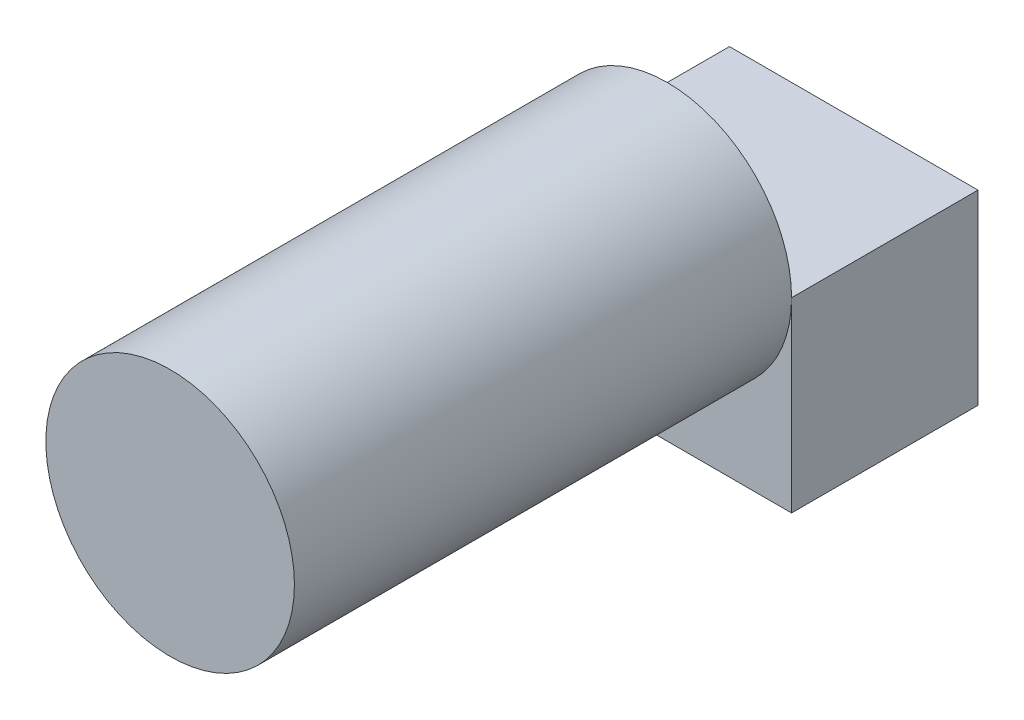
ISO-10303-21;
HEADER;
FILE_DESCRIPTION(('STEP AP214'),'2;1');
FILE_NAME('part.step','',(''),(''),'','','');
FILE_SCHEMA(('AUTOMOTIVE_DESIGN { 1 0 10303 214 1 1 1 1 }'));
ENDSEC;
DATA;
#1=APPLICATION_CONTEXT('core data for automotive mechanical design processes');
#2=APPLICATION_PROTOCOL_DEFINITION('international standard','automotive_design',2000,#1);
#3=PRODUCT_CONTEXT('',#1,'mechanical');
#4=PRODUCT('Part','Part','',(#3));
#5=PRODUCT_RELATED_PRODUCT_CATEGORY('part','',(#4));
#6=PRODUCT_DEFINITION_FORMATION('','',#4);
#7=PRODUCT_DEFINITION_CONTEXT('part definition',#1,'design');
#8=PRODUCT_DEFINITION('design','',#6,#7);
#9=PRODUCT_DEFINITION_SHAPE('','',#8);
#10=(LENGTH_UNIT() NAMED_UNIT(*) SI_UNIT(.MILLI.,.METRE.));
#11=(NAMED_UNIT(*) PLANE_ANGLE_UNIT() SI_UNIT($,.RADIAN.));
#12=(NAMED_UNIT(*) SI_UNIT($,.STERADIAN.) SOLID_ANGLE_UNIT());
#13=UNCERTAINTY_MEASURE_WITH_UNIT(LENGTH_MEASURE(1.E-05),#10,'distance_accuracy_value','');
#14=(GEOMETRIC_REPRESENTATION_CONTEXT(3) GLOBAL_UNCERTAINTY_ASSIGNED_CONTEXT((#13)) GLOBAL_UNIT_ASSIGNED_CONTEXT((#10,
#11,#12)) REPRESENTATION_CONTEXT('',''));
#15=CARTESIAN_POINT('',(0.,0.,0.));
#16=DIRECTION('',(0.,0.,1.));
#17=DIRECTION('',(1.,0.,0.));
#18=AXIS2_PLACEMENT_3D('',#15,#16,#17);
#19=CARTESIAN_POINT('',(-12.0233606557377,8.01557377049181,15.));
#20=DIRECTION('',(1.,0.,0.));
#21=DIRECTION('',(0.,1.,0.));
#22=AXIS2_PLACEMENT_3D('',#19,#20,#21);
#23=PLANE('',#22);
#24=DIRECTION('',(0.,-1.,0.));
#25=VECTOR('',#24,1.);
#26=CARTESIAN_POINT('',(-12.0233606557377,8.01557377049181,0.));
#27=LINE('',#26,#25);
#28=CARTESIAN_POINT('',(-12.0233606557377,8.01557377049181,0.));
#29=VERTEX_POINT('',#28);
#30=CARTESIAN_POINT('',(-12.0233606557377,-6.98442622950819,0.));
#31=VERTEX_POINT('',#30);
#32=EDGE_CURVE('E417',#29,#31,#27,.T.);
#33=ORIENTED_EDGE('',*,*,#32,.T.);
#34=DIRECTION('',(0.,0.,-1.));
#35=VECTOR('',#34,1.);
#36=CARTESIAN_POINT('',(-12.0233606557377,-6.98442622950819,15.));
#37=LINE('',#36,#35);
#38=CARTESIAN_POINT('',(-12.0233606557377,-6.98442622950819,15.));
#39=VERTEX_POINT('',#38);
#40=EDGE_CURVE('E352',#39,#31,#37,.T.);
#41=ORIENTED_EDGE('',*,*,#40,.F.);
#42=DIRECTION('',(0.,-1.,0.));
#43=VECTOR('',#42,1.);
#44=CARTESIAN_POINT('',(-12.0233606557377,8.01557377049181,15.));
#45=LINE('',#44,#43);
#46=CARTESIAN_POINT('',(-12.0233606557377,8.01557377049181,15.));
#47=VERTEX_POINT('',#46);
#48=EDGE_CURVE('E427',#47,#39,#45,.T.);
#49=ORIENTED_EDGE('',*,*,#48,.F.);
#50=DIRECTION('',(0.,0.,-1.));
#51=VECTOR('',#50,1.);
#52=CARTESIAN_POINT('',(-12.0233606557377,8.01557377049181,15.));
#53=LINE('',#52,#51);
#54=EDGE_CURVE('E395',#47,#29,#53,.T.);
#55=ORIENTED_EDGE('',*,*,#54,.T.);
#56=EDGE_LOOP('',(#33,#41,#49,#55));
#57=FACE_BOUND('',#56,.T.);
#58=ADVANCED_FACE('F349',(#57),#23,.F.);
#59=CARTESIAN_POINT('',(-12.0233606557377,-6.98442622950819,15.));
#60=DIRECTION('',(0.,1.,0.));
#61=DIRECTION('',(0.,0.,1.));
#62=AXIS2_PLACEMENT_3D('',#59,#60,#61);
#63=PLANE('',#62);
#64=DIRECTION('',(1.,0.,0.));
#65=VECTOR('',#64,1.);
#66=CARTESIAN_POINT('',(-12.0233606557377,-6.98442622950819,0.));
#67=LINE('',#66,#65);
#68=CARTESIAN_POINT('',(7.97663934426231,-6.98442622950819,0.));
#69=VERTEX_POINT('',#68);
#70=EDGE_CURVE('E422',#31,#69,#67,.T.);
#71=ORIENTED_EDGE('',*,*,#70,.T.);
#72=DIRECTION('',(0.,0.,-1.));
#73=VECTOR('',#72,1.);
#74=CARTESIAN_POINT('',(7.97663934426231,-6.98442622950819,15.));
#75=LINE('',#74,#73);
#76=CARTESIAN_POINT('',(7.97663934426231,-6.98442622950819,15.));
#77=VERTEX_POINT('',#76);
#78=EDGE_CURVE('E408',#77,#69,#75,.T.);
#79=ORIENTED_EDGE('',*,*,#78,.F.);
#80=DIRECTION('',(1.,0.,0.));
#81=VECTOR('',#80,1.);
#82=CARTESIAN_POINT('',(-12.0233606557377,-6.98442622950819,15.));
#83=LINE('',#82,#81);
#84=EDGE_CURVE('E368',#39,#77,#83,.T.);
#85=ORIENTED_EDGE('',*,*,#84,.F.);
#86=ORIENTED_EDGE('',*,*,#40,.T.);
#87=EDGE_LOOP('',(#71,#79,#85,#86));
#88=FACE_BOUND('',#87,.T.);
#89=ADVANCED_FACE('F433',(#88),#63,.F.);
#90=CARTESIAN_POINT('',(7.9766393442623,8.01557377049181,15.));
#91=DIRECTION('',(-1.,0.,0.));
#92=DIRECTION('',(0.,-1.,0.));
#93=AXIS2_PLACEMENT_3D('',#90,#91,#92);
#94=PLANE('',#93);
#95=DIRECTION('',(0.,1.,0.));
#96=VECTOR('',#95,1.);
#97=CARTESIAN_POINT('',(7.9766393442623,8.01557377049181,0.));
#98=LINE('',#97,#96);
#99=CARTESIAN_POINT('',(7.9766393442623,8.01557377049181,0.));
#100=VERTEX_POINT('',#99);
#101=EDGE_CURVE('E407',#69,#100,#98,.T.);
#102=ORIENTED_EDGE('',*,*,#101,.T.);
#103=DIRECTION('',(0.,0.,-1.));
#104=VECTOR('',#103,1.);
#105=CARTESIAN_POINT('',(7.9766393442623,8.01557377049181,15.));
#106=LINE('',#105,#104);
#107=CARTESIAN_POINT('',(7.9766393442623,8.01557377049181,15.));
#108=VERTEX_POINT('',#107);
#109=EDGE_CURVE('E392',#108,#100,#106,.T.);
#110=ORIENTED_EDGE('',*,*,#109,.F.);
#111=DIRECTION('',(0.,1.,0.));
#112=VECTOR('',#111,1.);
#113=CARTESIAN_POINT('',(7.9766393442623,8.01557377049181,15.));
#114=LINE('',#113,#112);
#115=EDGE_CURVE('E400',#77,#108,#114,.T.);
#116=ORIENTED_EDGE('',*,*,#115,.F.);
#117=ORIENTED_EDGE('',*,*,#78,.T.);
#118=EDGE_LOOP('',(#102,#110,#116,#117));
#119=FACE_BOUND('',#118,.T.);
#120=ADVANCED_FACE('F404',(#119),#94,.F.);
#121=CARTESIAN_POINT('',(-12.0233606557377,8.01557377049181,15.));
#122=DIRECTION('',(0.,-1.,0.));
#123=DIRECTION('',(0.,0.,-1.));
#124=AXIS2_PLACEMENT_3D('',#121,#122,#123);
#125=PLANE('',#124);
#126=DIRECTION('',(-1.,0.,0.));
#127=VECTOR('',#126,1.);
#128=CARTESIAN_POINT('',(-12.0233606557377,8.01557377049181,0.));
#129=LINE('',#128,#127);
#130=EDGE_CURVE('E425',#100,#29,#129,.T.);
#131=ORIENTED_EDGE('',*,*,#130,.T.);
#132=ORIENTED_EDGE('',*,*,#54,.F.);
#133=DIRECTION('',(-1.,0.,0.));
#134=VECTOR('',#133,1.);
#135=CARTESIAN_POINT('',(-12.0233606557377,8.01557377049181,15.));
#136=LINE('',#135,#134);
#137=EDGE_CURVE('E389',#108,#47,#136,.T.);
#138=ORIENTED_EDGE('',*,*,#137,.F.);
#139=ORIENTED_EDGE('',*,*,#109,.T.);
#140=EDGE_LOOP('',(#131,#132,#138,#139));
#141=FACE_BOUND('',#140,.T.);
#142=ADVANCED_FACE('F391',(#141),#125,.F.);
#143=CARTESIAN_POINT('',(-12.0233606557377,-6.98442622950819,15.));
#144=DIRECTION('',(0.,0.,1.));
#145=DIRECTION('',(1.,0.,0.));
#146=AXIS2_PLACEMENT_3D('',#143,#144,#145);
#147=PLANE('',#146);
#148=CARTESIAN_POINT('',(-2.0233606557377,8.01557377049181,15.));
#149=DIRECTION('',(0.,0.,1.));
#150=DIRECTION('',(1.,0.,0.));
#151=AXIS2_PLACEMENT_3D('',#148,#149,#150);
#152=CIRCLE('',#151,10.);
#153=EDGE_CURVE('E11',#47,#108,#152,.T.);
#154=ORIENTED_EDGE('',*,*,#153,.F.);
#155=ORIENTED_EDGE('',*,*,#48,.T.);
#156=ORIENTED_EDGE('',*,*,#84,.T.);
#157=ORIENTED_EDGE('',*,*,#115,.T.);
#158=EDGE_LOOP('',(#154,#155,#156,#157));
#159=FACE_BOUND('',#158,.T.);
#160=ADVANCED_FACE('F410',(#159),#147,.T.);
#161=CARTESIAN_POINT('',(-12.0233606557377,-6.98442622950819,0.));
#162=DIRECTION('',(0.,0.,1.));
#163=DIRECTION('',(1.,0.,0.));
#164=AXIS2_PLACEMENT_3D('',#161,#162,#163);
#165=PLANE('',#164);
#166=ORIENTED_EDGE('',*,*,#32,.F.);
#167=ORIENTED_EDGE('',*,*,#130,.F.);
#168=ORIENTED_EDGE('',*,*,#101,.F.);
#169=ORIENTED_EDGE('',*,*,#70,.F.);
#170=EDGE_LOOP('',(#166,#167,#168,#169));
#171=FACE_BOUND('',#170,.T.);
#172=ADVANCED_FACE('F437',(#171),#165,.F.);
#173=CARTESIAN_POINT('',(-2.0233606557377,8.01557377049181,15.));
#174=DIRECTION('',(0.,0.,1.));
#175=DIRECTION('',(1.,0.,0.));
#176=AXIS2_PLACEMENT_3D('',#173,#174,#175);
#177=PLANE('',#176);
#178=EDGE_CURVE('E358',#108,#47,#152,.T.);
#179=ORIENTED_EDGE('',*,*,#178,.F.);
#180=ORIENTED_EDGE('',*,*,#137,.T.);
#181=EDGE_LOOP('',(#179,#180));
#182=FACE_BOUND('',#181,.T.);
#183=ADVANCED_FACE('F414',(#182),#177,.F.);
#184=CARTESIAN_POINT('',(-2.0233606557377,8.01557377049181,55.));
#185=DIRECTION('',(0.,0.,-1.));
#186=DIRECTION('',(-1.,0.,0.));
#187=AXIS2_PLACEMENT_3D('',#184,#185,#186);
#188=CYLINDRICAL_SURFACE('',#187,10.);
#189=CARTESIAN_POINT('',(-2.0233606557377,8.01557377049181,55.));
#190=DIRECTION('',(0.,0.,1.));
#191=DIRECTION('',(1.,0.,0.));
#192=AXIS2_PLACEMENT_3D('',#189,#190,#191);
#193=CIRCLE('',#192,10.);
#194=CARTESIAN_POINT('',(7.9766393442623,8.01557377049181,55.));
#195=VERTEX_POINT('',#194);
#196=EDGE_CURVE('E415',#195,#195,#193,.T.);
#197=ORIENTED_EDGE('',*,*,#196,.F.);
#198=EDGE_LOOP('',(#197));
#199=FACE_BOUND('',#198,.T.);
#200=ORIENTED_EDGE('',*,*,#178,.T.);
#201=ORIENTED_EDGE('',*,*,#153,.T.);
#202=EDGE_LOOP('',(#200,#201));
#203=FACE_BOUND('',#202,.T.);
#204=ADVANCED_FACE('F413',(#199,#203),#188,.T.);
#205=CARTESIAN_POINT('',(-2.0233606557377,8.01557377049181,55.));
#206=DIRECTION('',(0.,0.,1.));
#207=DIRECTION('',(1.,0.,0.));
#208=AXIS2_PLACEMENT_3D('',#205,#206,#207);
#209=PLANE('',#208);
#210=ORIENTED_EDGE('',*,*,#196,.T.);
#211=EDGE_LOOP('',(#210));
#212=FACE_BOUND('',#211,.T.);
#213=ADVANCED_FACE('F475',(#212),#209,.T.);
#214=CLOSED_SHELL('',(#58,#89,#120,#142,#160,#172,#183,#204,#213));
#215=MANIFOLD_SOLID_BREP('B2',#214);
#216=ADVANCED_BREP_SHAPE_REPRESENTATION('',(#18,#215),#14);
#217=SHAPE_DEFINITION_REPRESENTATION(#9,#216);
ENDSEC;
END-ISO-10303-21;
